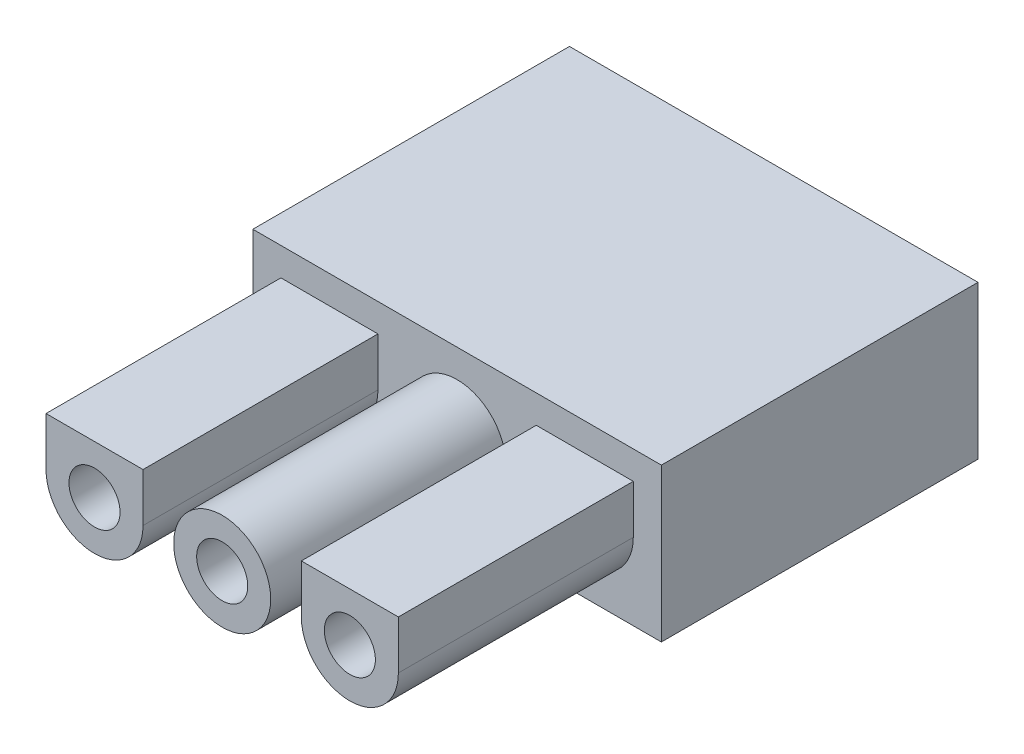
from build123d import *

# Parameters (mm, degrees)
SKETCH1_W           = 20.32
SKETCH1_H           = 7.62
BASE_EXTRUDE_DEPTH  = 15.748
SKETCH2_R           = 2.413
BOSS_EXTRUDE1_DEPTH = 11.684
SKETCH3_R           = 1.27
CUT_EXTRUDE1_DEPTH  = 35.97829933


with BuildPart() as part:
    # Sketch1 → Base-Extrude (new body)
    with BuildSketch(Plane.XY):
        with Locations((10.16, -3.81)):
            Rectangle(SKETCH1_W, SKETCH1_H)
    extrude(amount=BASE_EXTRUDE_DEPTH)

    # Sketch2 → Boss-Extrude1 (add)
    with BuildSketch(Plane.XY.offset(15.748)):
        with Locations((10.16, -3.81)):
            Circle(SKETCH2_R)
        with BuildLine():
            Line((18.923, -3.81), (18.923, -1.397))
            Line((18.923, -1.397), (16.51, -1.397))
            Line((16.51, -1.397), (14.097, -1.397))
            Line((14.097, -1.397), (14.097, -3.81))
            ThreePointArc((14.097, -3.81), (16.51, -6.223), (18.923, -3.81))
        make_face()
        with BuildLine():
            Line((1.397, -3.81), (1.397, -1.397))
            Line((1.397, -1.397), (3.81, -1.397))
            Line((3.81, -1.397), (6.223, -1.397))
            Line((6.223, -1.397), (6.223, -3.81))
            ThreePointArc((6.223, -3.81), (3.81, -6.223), (1.397, -3.81))
        make_face()
    extrude(amount=BOSS_EXTRUDE1_DEPTH)

    # Sketch3 → Cut-Extrude1 (cut, through all)
    with BuildSketch(Plane(origin=(0, 0, 0), x_dir=(-1, 0, 0), z_dir=(0, 0, -1))):
        with Locations((-3.81, -3.81)):
            Circle(SKETCH3_R)
        with Locations((-16.51, -3.81)):
            Circle(SKETCH3_R)
        with Locations((-10.16, -3.81)):
            Circle(SKETCH3_R)
    extrude(amount=-CUT_EXTRUDE1_DEPTH, mode=Mode.SUBTRACT)


solid = part.part
